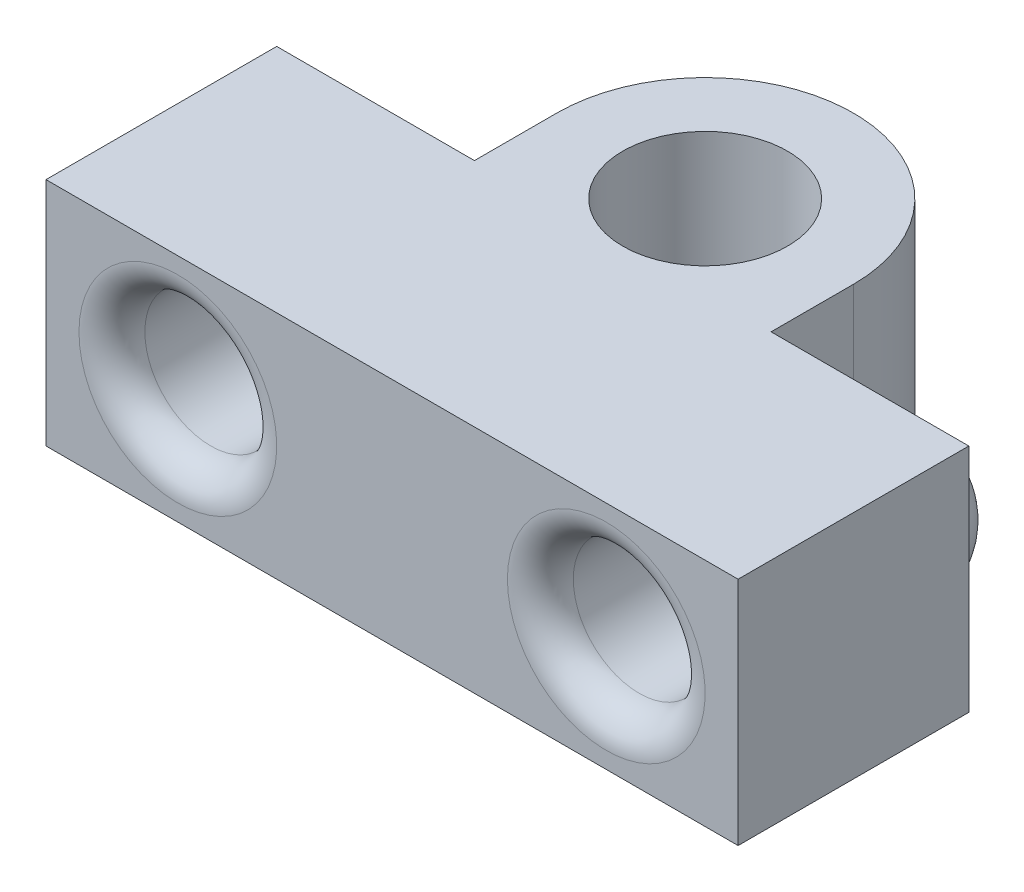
ISO-10303-21;
HEADER;
FILE_DESCRIPTION(('STEP AP214'),'2;1');
FILE_NAME('part.step','',(''),(''),'','','');
FILE_SCHEMA(('AUTOMOTIVE_DESIGN { 1 0 10303 214 1 1 1 1 }'));
ENDSEC;
DATA;
#1=APPLICATION_CONTEXT('core data for automotive mechanical design processes');
#2=APPLICATION_PROTOCOL_DEFINITION('international standard','automotive_design',2000,#1);
#3=PRODUCT_CONTEXT('',#1,'mechanical');
#4=PRODUCT('Part','Part','',(#3));
#5=PRODUCT_RELATED_PRODUCT_CATEGORY('part','',(#4));
#6=PRODUCT_DEFINITION_FORMATION('','',#4);
#7=PRODUCT_DEFINITION_CONTEXT('part definition',#1,'design');
#8=PRODUCT_DEFINITION('design','',#6,#7);
#9=PRODUCT_DEFINITION_SHAPE('','',#8);
#10=(LENGTH_UNIT() NAMED_UNIT(*) SI_UNIT(.MILLI.,.METRE.));
#11=(NAMED_UNIT(*) PLANE_ANGLE_UNIT() SI_UNIT($,.RADIAN.));
#12=(NAMED_UNIT(*) SI_UNIT($,.STERADIAN.) SOLID_ANGLE_UNIT());
#13=UNCERTAINTY_MEASURE_WITH_UNIT(LENGTH_MEASURE(1.E-05),#10,'distance_accuracy_value','');
#14=(GEOMETRIC_REPRESENTATION_CONTEXT(3) GLOBAL_UNCERTAINTY_ASSIGNED_CONTEXT((#13)) GLOBAL_UNIT_ASSIGNED_CONTEXT((#10,
#11,#12)) REPRESENTATION_CONTEXT('',''));
#15=CARTESIAN_POINT('',(0.,0.,0.));
#16=DIRECTION('',(0.,0.,1.));
#17=DIRECTION('',(1.,0.,0.));
#18=AXIS2_PLACEMENT_3D('',#15,#16,#17);
#19=CARTESIAN_POINT('',(0.,7.,0.));
#20=DIRECTION('',(0.,0.,-1.));
#21=DIRECTION('',(-1.,0.,0.));
#22=AXIS2_PLACEMENT_3D('',#19,#20,#21);
#23=PLANE('',#22);
#24=CARTESIAN_POINT('',(7.5,3.5,0.));
#25=DIRECTION('',(0.,0.,-1.));
#26=DIRECTION('',(-1.,0.,0.));
#27=AXIS2_PLACEMENT_3D('',#24,#25,#26);
#28=CIRCLE('',#27,2.25);
#29=CARTESIAN_POINT('',(5.25,3.5,0.));
#30=VERTEX_POINT('',#29);
#31=EDGE_CURVE('E184',#30,#30,#28,.T.);
#32=ORIENTED_EDGE('',*,*,#31,.F.);
#33=EDGE_LOOP('',(#32));
#34=FACE_BOUND('',#33,.T.);
#35=DIRECTION('',(1.,0.,0.));
#36=VECTOR('',#35,1.);
#37=CARTESIAN_POINT('',(0.,0.,0.));
#38=LINE('',#37,#36);
#39=CARTESIAN_POINT('',(4.50000000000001,0.,0.));
#40=VERTEX_POINT('',#39);
#41=CARTESIAN_POINT('',(10.5,0.,0.));
#42=VERTEX_POINT('',#41);
#43=EDGE_CURVE('E140',#40,#42,#38,.T.);
#44=ORIENTED_EDGE('',*,*,#43,.F.);
#45=DIRECTION('',(0.,-1.,0.));
#46=VECTOR('',#45,1.);
#47=CARTESIAN_POINT('',(4.50000000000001,7.,0.));
#48=LINE('',#47,#46);
#49=CARTESIAN_POINT('',(4.50000000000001,7.,0.));
#50=VERTEX_POINT('',#49);
#51=EDGE_CURVE('E94',#50,#40,#48,.T.);
#52=ORIENTED_EDGE('',*,*,#51,.F.);
#53=DIRECTION('',(1.,0.,0.));
#54=VECTOR('',#53,1.);
#55=CARTESIAN_POINT('',(0.,7.,0.));
#56=LINE('',#55,#54);
#57=CARTESIAN_POINT('',(10.5,7.,0.));
#58=VERTEX_POINT('',#57);
#59=EDGE_CURVE('E163',#50,#58,#56,.T.);
#60=ORIENTED_EDGE('',*,*,#59,.T.);
#61=DIRECTION('',(0.,-1.,0.));
#62=VECTOR('',#61,1.);
#63=CARTESIAN_POINT('',(10.5,7.,0.));
#64=LINE('',#63,#62);
#65=EDGE_CURVE('E58',#58,#42,#64,.T.);
#66=ORIENTED_EDGE('',*,*,#65,.T.);
#67=EDGE_LOOP('',(#44,#52,#60,#66));
#68=FACE_BOUND('',#67,.T.);
#69=ADVANCED_FACE('F39',(#34,#68),#23,.T.);
#70=CARTESIAN_POINT('',(4.50000000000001,7.,0.));
#71=DIRECTION('',(1.,0.,0.));
#72=DIRECTION('',(0.,0.,-1.));
#73=AXIS2_PLACEMENT_3D('',#70,#71,#72);
#74=PLANE('',#73);
#75=DIRECTION('',(0.,0.,1.));
#76=VECTOR('',#75,1.);
#77=CARTESIAN_POINT('',(4.50000000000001,0.,0.));
#78=LINE('',#77,#76);
#79=CARTESIAN_POINT('',(4.50000000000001,0.,-2.5));
#80=VERTEX_POINT('',#79);
#81=EDGE_CURVE('E142',#80,#40,#78,.T.);
#82=ORIENTED_EDGE('',*,*,#81,.F.);
#83=DIRECTION('',(0.,-1.,0.));
#84=VECTOR('',#83,1.);
#85=CARTESIAN_POINT('',(4.50000000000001,7.,-2.5));
#86=LINE('',#85,#84);
#87=CARTESIAN_POINT('',(4.50000000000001,7.,-2.5));
#88=VERTEX_POINT('',#87);
#89=EDGE_CURVE('E172',#88,#80,#86,.T.);
#90=ORIENTED_EDGE('',*,*,#89,.F.);
#91=DIRECTION('',(0.,0.,1.));
#92=VECTOR('',#91,1.);
#93=CARTESIAN_POINT('',(4.50000000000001,7.,0.));
#94=LINE('',#93,#92);
#95=EDGE_CURVE('E201',#88,#50,#94,.T.);
#96=ORIENTED_EDGE('',*,*,#95,.T.);
#97=ORIENTED_EDGE('',*,*,#51,.T.);
#98=EDGE_LOOP('',(#82,#90,#96,#97));
#99=FACE_BOUND('',#98,.T.);
#100=ADVANCED_FACE('F229',(#99),#74,.T.);
#101=CARTESIAN_POINT('',(0.,7.,-2.5));
#102=DIRECTION('',(0.,-1.,0.));
#103=DIRECTION('',(0.,0.,-1.));
#104=AXIS2_PLACEMENT_3D('',#101,#102,#103);
#105=CYLINDRICAL_SURFACE('',#104,4.5);
#106=CARTESIAN_POINT('',(0.,0.,-2.5));
#107=DIRECTION('',(0.,1.,0.));
#108=DIRECTION('',(0.,0.,1.));
#109=AXIS2_PLACEMENT_3D('',#106,#107,#108);
#110=CIRCLE('',#109,4.5);
#111=CARTESIAN_POINT('',(-4.49999999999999,0.,-2.5));
#112=VERTEX_POINT('',#111);
#113=EDGE_CURVE('E146',#80,#112,#110,.T.);
#114=ORIENTED_EDGE('',*,*,#113,.T.);
#115=DIRECTION('',(0.,-1.,0.));
#116=VECTOR('',#115,1.);
#117=CARTESIAN_POINT('',(-4.49999999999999,7.,-2.5));
#118=LINE('',#117,#116);
#119=CARTESIAN_POINT('',(-4.49999999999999,7.,-2.5));
#120=VERTEX_POINT('',#119);
#121=EDGE_CURVE('E169',#120,#112,#118,.T.);
#122=ORIENTED_EDGE('',*,*,#121,.F.);
#123=CARTESIAN_POINT('',(0.,7.,-2.5));
#124=DIRECTION('',(0.,1.,0.));
#125=DIRECTION('',(0.,0.,1.));
#126=AXIS2_PLACEMENT_3D('',#123,#124,#125);
#127=CIRCLE('',#126,4.5);
#128=EDGE_CURVE('E204',#88,#120,#127,.T.);
#129=ORIENTED_EDGE('',*,*,#128,.F.);
#130=ORIENTED_EDGE('',*,*,#89,.T.);
#131=EDGE_LOOP('',(#114,#122,#129,#130));
#132=FACE_BOUND('',#131,.T.);
#133=ADVANCED_FACE('F237',(#132),#105,.T.);
#134=CARTESIAN_POINT('',(-4.49999999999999,7.,0.));
#135=DIRECTION('',(1.,0.,0.));
#136=DIRECTION('',(0.,0.,-1.));
#137=AXIS2_PLACEMENT_3D('',#134,#135,#136);
#138=PLANE('',#137);
#139=DIRECTION('',(0.,0.,1.));
#140=VECTOR('',#139,1.);
#141=CARTESIAN_POINT('',(-4.49999999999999,0.,0.));
#142=LINE('',#141,#140);
#143=CARTESIAN_POINT('',(-4.49999999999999,0.,0.));
#144=VERTEX_POINT('',#143);
#145=EDGE_CURVE('E148',#112,#144,#142,.T.);
#146=ORIENTED_EDGE('',*,*,#145,.T.);
#147=DIRECTION('',(0.,-1.,0.));
#148=VECTOR('',#147,1.);
#149=CARTESIAN_POINT('',(-4.49999999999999,7.,0.));
#150=LINE('',#149,#148);
#151=CARTESIAN_POINT('',(-4.49999999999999,7.,0.));
#152=VERTEX_POINT('',#151);
#153=EDGE_CURVE('E167',#152,#144,#150,.T.);
#154=ORIENTED_EDGE('',*,*,#153,.F.);
#155=DIRECTION('',(0.,0.,1.));
#156=VECTOR('',#155,1.);
#157=CARTESIAN_POINT('',(-4.49999999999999,7.,0.));
#158=LINE('',#157,#156);
#159=EDGE_CURVE('E206',#120,#152,#158,.T.);
#160=ORIENTED_EDGE('',*,*,#159,.F.);
#161=ORIENTED_EDGE('',*,*,#121,.T.);
#162=EDGE_LOOP('',(#146,#154,#160,#161));
#163=FACE_BOUND('',#162,.T.);
#164=ADVANCED_FACE('F384',(#163),#138,.F.);
#165=CARTESIAN_POINT('',(0.,7.,0.));
#166=DIRECTION('',(0.,0.,-1.));
#167=DIRECTION('',(-1.,0.,0.));
#168=AXIS2_PLACEMENT_3D('',#165,#166,#167);
#169=PLANE('',#168);
#170=CARTESIAN_POINT('',(-7.5,3.5,0.));
#171=DIRECTION('',(0.,0.,-1.));
#172=DIRECTION('',(-1.,0.,0.));
#173=AXIS2_PLACEMENT_3D('',#170,#171,#172);
#174=CIRCLE('',#173,2.25);
#175=CARTESIAN_POINT('',(-9.75000000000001,3.5,0.));
#176=VERTEX_POINT('',#175);
#177=EDGE_CURVE('E188',#176,#176,#174,.T.);
#178=ORIENTED_EDGE('',*,*,#177,.F.);
#179=EDGE_LOOP('',(#178));
#180=FACE_BOUND('',#179,.T.);
#181=DIRECTION('',(1.,0.,0.));
#182=VECTOR('',#181,1.);
#183=CARTESIAN_POINT('',(0.,0.,0.));
#184=LINE('',#183,#182);
#185=CARTESIAN_POINT('',(-10.5,0.,0.));
#186=VERTEX_POINT('',#185);
#187=EDGE_CURVE('E151',#186,#144,#184,.T.);
#188=ORIENTED_EDGE('',*,*,#187,.F.);
#189=DIRECTION('',(0.,-1.,0.));
#190=VECTOR('',#189,1.);
#191=CARTESIAN_POINT('',(-10.5,7.,0.));
#192=LINE('',#191,#190);
#193=CARTESIAN_POINT('',(-10.5,7.,0.));
#194=VERTEX_POINT('',#193);
#195=EDGE_CURVE('E129',#194,#186,#192,.T.);
#196=ORIENTED_EDGE('',*,*,#195,.F.);
#197=DIRECTION('',(1.,0.,0.));
#198=VECTOR('',#197,1.);
#199=CARTESIAN_POINT('',(0.,7.,0.));
#200=LINE('',#199,#198);
#201=EDGE_CURVE('E119',#194,#152,#200,.T.);
#202=ORIENTED_EDGE('',*,*,#201,.T.);
#203=ORIENTED_EDGE('',*,*,#153,.T.);
#204=EDGE_LOOP('',(#188,#196,#202,#203));
#205=FACE_BOUND('',#204,.T.);
#206=ADVANCED_FACE('F209',(#180,#205),#169,.T.);
#207=CARTESIAN_POINT('',(-10.5,7.,0.));
#208=DIRECTION('',(1.,0.,0.));
#209=DIRECTION('',(0.,0.,-1.));
#210=AXIS2_PLACEMENT_3D('',#207,#208,#209);
#211=PLANE('',#210);
#212=DIRECTION('',(0.,0.,1.));
#213=VECTOR('',#212,1.);
#214=CARTESIAN_POINT('',(-10.5,0.,0.));
#215=LINE('',#214,#213);
#216=CARTESIAN_POINT('',(-10.5,0.,7.));
#217=VERTEX_POINT('',#216);
#218=EDGE_CURVE('E126',#186,#217,#215,.T.);
#219=ORIENTED_EDGE('',*,*,#218,.T.);
#220=DIRECTION('',(0.,-1.,0.));
#221=VECTOR('',#220,1.);
#222=CARTESIAN_POINT('',(-10.5,7.,7.));
#223=LINE('',#222,#221);
#224=CARTESIAN_POINT('',(-10.5,7.,7.));
#225=VERTEX_POINT('',#224);
#226=EDGE_CURVE('E123',#225,#217,#223,.T.);
#227=ORIENTED_EDGE('',*,*,#226,.F.);
#228=DIRECTION('',(0.,0.,1.));
#229=VECTOR('',#228,1.);
#230=CARTESIAN_POINT('',(-10.5,7.,0.));
#231=LINE('',#230,#229);
#232=EDGE_CURVE('E111',#194,#225,#231,.T.);
#233=ORIENTED_EDGE('',*,*,#232,.F.);
#234=ORIENTED_EDGE('',*,*,#195,.T.);
#235=EDGE_LOOP('',(#219,#227,#233,#234));
#236=FACE_BOUND('',#235,.T.);
#237=ADVANCED_FACE('F124',(#236),#211,.F.);
#238=CARTESIAN_POINT('',(0.,7.,7.));
#239=DIRECTION('',(0.,0.,-1.));
#240=DIRECTION('',(-1.,0.,0.));
#241=AXIS2_PLACEMENT_3D('',#238,#239,#240);
#242=PLANE('',#241);
#243=CARTESIAN_POINT('',(6.5,3.5,7.));
#244=DIRECTION('',(0.,0.,-1.));
#245=DIRECTION('',(-1.,0.,0.));
#246=AXIS2_PLACEMENT_3D('',#243,#244,#245);
#247=CIRCLE('',#246,3.);
#248=CARTESIAN_POINT('',(3.5,3.5,7.));
#249=VERTEX_POINT('',#248);
#250=EDGE_CURVE('E49',#249,#249,#247,.T.);
#251=ORIENTED_EDGE('',*,*,#250,.T.);
#252=EDGE_LOOP('',(#251));
#253=FACE_BOUND('',#252,.T.);
#254=CARTESIAN_POINT('',(-6.5,3.5,7.));
#255=DIRECTION('',(0.,0.,-1.));
#256=DIRECTION('',(-1.,0.,0.));
#257=AXIS2_PLACEMENT_3D('',#254,#255,#256);
#258=CIRCLE('',#257,3.);
#259=CARTESIAN_POINT('',(-9.5,3.5,7.));
#260=VERTEX_POINT('',#259);
#261=EDGE_CURVE('E178',#260,#260,#258,.T.);
#262=ORIENTED_EDGE('',*,*,#261,.T.);
#263=EDGE_LOOP('',(#262));
#264=FACE_BOUND('',#263,.T.);
#265=DIRECTION('',(1.,0.,0.));
#266=VECTOR('',#265,1.);
#267=CARTESIAN_POINT('',(0.,0.,7.));
#268=LINE('',#267,#266);
#269=CARTESIAN_POINT('',(10.5,0.,7.));
#270=VERTEX_POINT('',#269);
#271=EDGE_CURVE('E155',#217,#270,#268,.T.);
#272=ORIENTED_EDGE('',*,*,#271,.T.);
#273=DIRECTION('',(0.,-1.,0.));
#274=VECTOR('',#273,1.);
#275=CARTESIAN_POINT('',(10.5,7.,7.));
#276=LINE('',#275,#274);
#277=CARTESIAN_POINT('',(10.5,7.,7.));
#278=VERTEX_POINT('',#277);
#279=EDGE_CURVE('E85',#278,#270,#276,.T.);
#280=ORIENTED_EDGE('',*,*,#279,.F.);
#281=DIRECTION('',(1.,0.,0.));
#282=VECTOR('',#281,1.);
#283=CARTESIAN_POINT('',(0.,7.,7.));
#284=LINE('',#283,#282);
#285=EDGE_CURVE('E117',#225,#278,#284,.T.);
#286=ORIENTED_EDGE('',*,*,#285,.F.);
#287=ORIENTED_EDGE('',*,*,#226,.T.);
#288=EDGE_LOOP('',(#272,#280,#286,#287));
#289=FACE_BOUND('',#288,.T.);
#290=ADVANCED_FACE('F131',(#253,#264,#289),#242,.F.);
#291=CARTESIAN_POINT('',(10.5,7.,0.));
#292=DIRECTION('',(1.,0.,0.));
#293=DIRECTION('',(0.,0.,-1.));
#294=AXIS2_PLACEMENT_3D('',#291,#292,#293);
#295=PLANE('',#294);
#296=DIRECTION('',(0.,0.,1.));
#297=VECTOR('',#296,1.);
#298=CARTESIAN_POINT('',(10.5,0.,0.));
#299=LINE('',#298,#297);
#300=EDGE_CURVE('E157',#42,#270,#299,.T.);
#301=ORIENTED_EDGE('',*,*,#300,.F.);
#302=ORIENTED_EDGE('',*,*,#65,.F.);
#303=DIRECTION('',(0.,0.,1.));
#304=VECTOR('',#303,1.);
#305=CARTESIAN_POINT('',(10.5,7.,0.));
#306=LINE('',#305,#304);
#307=EDGE_CURVE('E132',#58,#278,#306,.T.);
#308=ORIENTED_EDGE('',*,*,#307,.T.);
#309=ORIENTED_EDGE('',*,*,#279,.T.);
#310=EDGE_LOOP('',(#301,#302,#308,#309));
#311=FACE_BOUND('',#310,.T.);
#312=ADVANCED_FACE('F215',(#311),#295,.T.);
#313=CARTESIAN_POINT('',(0.,7.,-2.5));
#314=DIRECTION('',(0.,-1.,0.));
#315=DIRECTION('',(0.,0.,-1.));
#316=AXIS2_PLACEMENT_3D('',#313,#314,#315);
#317=CYLINDRICAL_SURFACE('',#316,2.5);
#318=CARTESIAN_POINT('',(0.,7.,-2.5));
#319=DIRECTION('',(0.,1.,0.));
#320=DIRECTION('',(0.,0.,1.));
#321=AXIS2_PLACEMENT_3D('',#318,#319,#320);
#322=CIRCLE('',#321,2.5);
#323=CARTESIAN_POINT('',(0.,7.,0.));
#324=VERTEX_POINT('',#323);
#325=EDGE_CURVE('E134',#324,#324,#322,.T.);
#326=ORIENTED_EDGE('',*,*,#325,.T.);
#327=EDGE_LOOP('',(#326));
#328=FACE_BOUND('',#327,.T.);
#329=CARTESIAN_POINT('',(0.,0.,-2.5));
#330=DIRECTION('',(0.,1.,0.));
#331=DIRECTION('',(0.,0.,1.));
#332=AXIS2_PLACEMENT_3D('',#329,#330,#331);
#333=CIRCLE('',#332,2.5);
#334=CARTESIAN_POINT('',(0.,0.,0.));
#335=VERTEX_POINT('',#334);
#336=EDGE_CURVE('E160',#335,#335,#333,.T.);
#337=ORIENTED_EDGE('',*,*,#336,.F.);
#338=EDGE_LOOP('',(#337));
#339=FACE_BOUND('',#338,.T.);
#340=ADVANCED_FACE('F217',(#328,#339),#317,.F.);
#341=CARTESIAN_POINT('',(0.,7.,0.));
#342=DIRECTION('',(0.,1.,0.));
#343=DIRECTION('',(0.,0.,1.));
#344=AXIS2_PLACEMENT_3D('',#341,#342,#343);
#345=PLANE('',#344);
#346=ORIENTED_EDGE('',*,*,#59,.F.);
#347=ORIENTED_EDGE('',*,*,#95,.F.);
#348=ORIENTED_EDGE('',*,*,#128,.T.);
#349=ORIENTED_EDGE('',*,*,#159,.T.);
#350=ORIENTED_EDGE('',*,*,#201,.F.);
#351=ORIENTED_EDGE('',*,*,#232,.T.);
#352=ORIENTED_EDGE('',*,*,#285,.T.);
#353=ORIENTED_EDGE('',*,*,#307,.F.);
#354=EDGE_LOOP('',(#346,#347,#348,#349,#350,#351,#352,#353));
#355=FACE_BOUND('',#354,.T.);
#356=ORIENTED_EDGE('',*,*,#325,.F.);
#357=EDGE_LOOP('',(#356));
#358=FACE_BOUND('',#357,.T.);
#359=ADVANCED_FACE('F113',(#355,#358),#345,.T.);
#360=CARTESIAN_POINT('',(0.,0.,0.));
#361=DIRECTION('',(0.,1.,0.));
#362=DIRECTION('',(0.,0.,1.));
#363=AXIS2_PLACEMENT_3D('',#360,#361,#362);
#364=PLANE('',#363);
#365=ORIENTED_EDGE('',*,*,#43,.T.);
#366=ORIENTED_EDGE('',*,*,#300,.T.);
#367=ORIENTED_EDGE('',*,*,#271,.F.);
#368=ORIENTED_EDGE('',*,*,#218,.F.);
#369=ORIENTED_EDGE('',*,*,#187,.T.);
#370=ORIENTED_EDGE('',*,*,#145,.F.);
#371=ORIENTED_EDGE('',*,*,#113,.F.);
#372=ORIENTED_EDGE('',*,*,#81,.T.);
#373=EDGE_LOOP('',(#365,#366,#367,#368,#369,#370,#371,#372));
#374=FACE_BOUND('',#373,.T.);
#375=ORIENTED_EDGE('',*,*,#336,.T.);
#376=EDGE_LOOP('',(#375));
#377=FACE_BOUND('',#376,.T.);
#378=ADVANCED_FACE('F212',(#374,#377),#364,.F.);
#379=CARTESIAN_POINT('',(6.5,3.5,0.299999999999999));
#380=DIRECTION('',(0.,0.,1.));
#381=DIRECTION('',(1.,0.,0.));
#382=AXIS2_PLACEMENT_3D('',#379,#380,#381);
#383=CYLINDRICAL_SURFACE('',#382,2.);
#384=CARTESIAN_POINT('',(6.5,3.5,6.));
#385=DIRECTION('',(0.,0.,-1.));
#386=DIRECTION('',(-1.,0.,0.));
#387=AXIS2_PLACEMENT_3D('',#384,#385,#386);
#388=CIRCLE('',#387,2.);
#389=CARTESIAN_POINT('',(4.5,3.5,6.));
#390=VERTEX_POINT('',#389);
#391=EDGE_CURVE('E175',#390,#390,#388,.F.);
#392=ORIENTED_EDGE('',*,*,#391,.T.);
#393=EDGE_LOOP('',(#392));
#394=FACE_BOUND('',#393,.T.);
#395=CARTESIAN_POINT('',(6.5,3.5,0.299999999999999));
#396=DIRECTION('',(0.,0.,1.));
#397=DIRECTION('',(1.,0.,0.));
#398=AXIS2_PLACEMENT_3D('',#395,#396,#397);
#399=CIRCLE('',#398,2.);
#400=CARTESIAN_POINT('',(8.5,3.5,0.299999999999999));
#401=VERTEX_POINT('',#400);
#402=EDGE_CURVE('E197',#401,#401,#399,.T.);
#403=ORIENTED_EDGE('',*,*,#402,.F.);
#404=EDGE_LOOP('',(#403));
#405=FACE_BOUND('',#404,.T.);
#406=ADVANCED_FACE('F274',(#394,#405),#383,.F.);
#407=CARTESIAN_POINT('',(6.5,3.5,0.299999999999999));
#408=DIRECTION('',(0.,0.,1.));
#409=DIRECTION('',(1.,0.,0.));
#410=AXIS2_PLACEMENT_3D('',#407,#408,#409);
#411=PLANE('',#410);
#412=ORIENTED_EDGE('',*,*,#402,.T.);
#413=EDGE_LOOP('',(#412));
#414=FACE_BOUND('',#413,.T.);
#415=ADVANCED_FACE('F272',(#414),#411,.T.);
#416=CARTESIAN_POINT('',(-6.5,3.5,0.299999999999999));
#417=DIRECTION('',(0.,0.,1.));
#418=DIRECTION('',(1.,0.,0.));
#419=AXIS2_PLACEMENT_3D('',#416,#417,#418);
#420=CYLINDRICAL_SURFACE('',#419,2.);
#421=CARTESIAN_POINT('',(-6.5,3.5,6.));
#422=DIRECTION('',(0.,0.,-1.));
#423=DIRECTION('',(-1.,0.,0.));
#424=AXIS2_PLACEMENT_3D('',#421,#422,#423);
#425=CIRCLE('',#424,2.);
#426=CARTESIAN_POINT('',(-8.5,3.5,6.));
#427=VERTEX_POINT('',#426);
#428=EDGE_CURVE('E11',#427,#427,#425,.F.);
#429=ORIENTED_EDGE('',*,*,#428,.T.);
#430=EDGE_LOOP('',(#429));
#431=FACE_BOUND('',#430,.T.);
#432=CARTESIAN_POINT('',(-6.5,3.5,0.299999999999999));
#433=DIRECTION('',(0.,0.,1.));
#434=DIRECTION('',(1.,0.,0.));
#435=AXIS2_PLACEMENT_3D('',#432,#433,#434);
#436=CIRCLE('',#435,2.);
#437=CARTESIAN_POINT('',(-4.5,3.5,0.299999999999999));
#438=VERTEX_POINT('',#437);
#439=EDGE_CURVE('E143',#438,#438,#436,.T.);
#440=ORIENTED_EDGE('',*,*,#439,.F.);
#441=EDGE_LOOP('',(#440));
#442=FACE_BOUND('',#441,.T.);
#443=ADVANCED_FACE('F268',(#431,#442),#420,.F.);
#444=CARTESIAN_POINT('',(-6.5,3.5,0.299999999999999));
#445=DIRECTION('',(0.,0.,1.));
#446=DIRECTION('',(1.,0.,0.));
#447=AXIS2_PLACEMENT_3D('',#444,#445,#446);
#448=PLANE('',#447);
#449=ORIENTED_EDGE('',*,*,#439,.T.);
#450=EDGE_LOOP('',(#449));
#451=FACE_BOUND('',#450,.T.);
#452=ADVANCED_FACE('F246',(#451),#448,.T.);
#453=CARTESIAN_POINT('',(6.5,3.5,6.));
#454=DIRECTION('',(0.,0.,-1.));
#455=DIRECTION('',(-1.,0.,0.));
#456=AXIS2_PLACEMENT_3D('',#453,#454,#455);
#457=TOROIDAL_SURFACE('',#456,3.,1.);
#458=ORIENTED_EDGE('',*,*,#250,.F.);
#459=EDGE_LOOP('',(#458));
#460=FACE_BOUND('',#459,.T.);
#461=ORIENTED_EDGE('',*,*,#391,.F.);
#462=EDGE_LOOP('',(#461));
#463=FACE_BOUND('',#462,.T.);
#464=ADVANCED_FACE('F242',(#460,#463),#457,.T.);
#465=CARTESIAN_POINT('',(-6.5,3.5,6.));
#466=DIRECTION('',(0.,0.,-1.));
#467=DIRECTION('',(-1.,0.,0.));
#468=AXIS2_PLACEMENT_3D('',#465,#466,#467);
#469=TOROIDAL_SURFACE('',#468,3.,1.);
#470=ORIENTED_EDGE('',*,*,#261,.F.);
#471=EDGE_LOOP('',(#470));
#472=FACE_BOUND('',#471,.T.);
#473=ORIENTED_EDGE('',*,*,#428,.F.);
#474=EDGE_LOOP('',(#473));
#475=FACE_BOUND('',#474,.T.);
#476=ADVANCED_FACE('F245',(#472,#475),#469,.T.);
#477=CARTESIAN_POINT('',(-7.5,3.5,-0.0999999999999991));
#478=DIRECTION('',(0.,0.,1.));
#479=DIRECTION('',(1.,0.,0.));
#480=AXIS2_PLACEMENT_3D('',#477,#478,#479);
#481=CYLINDRICAL_SURFACE('',#480,2.25);
#482=CARTESIAN_POINT('',(-7.5,3.5,-0.0999999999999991));
#483=DIRECTION('',(0.,0.,-1.));
#484=DIRECTION('',(-1.,0.,0.));
#485=AXIS2_PLACEMENT_3D('',#482,#483,#484);
#486=CIRCLE('',#485,2.25);
#487=CARTESIAN_POINT('',(-9.75000000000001,3.5,-0.0999999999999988));
#488=VERTEX_POINT('',#487);
#489=EDGE_CURVE('E43',#488,#488,#486,.T.);
#490=ORIENTED_EDGE('',*,*,#489,.F.);
#491=EDGE_LOOP('',(#490));
#492=FACE_BOUND('',#491,.T.);
#493=ORIENTED_EDGE('',*,*,#177,.T.);
#494=EDGE_LOOP('',(#493));
#495=FACE_BOUND('',#494,.T.);
#496=ADVANCED_FACE('F248',(#492,#495),#481,.T.);
#497=CARTESIAN_POINT('',(-7.5,3.5,-0.0999999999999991));
#498=DIRECTION('',(0.,0.,1.));
#499=DIRECTION('',(1.,0.,0.));
#500=AXIS2_PLACEMENT_3D('',#497,#498,#499);
#501=SPHERICAL_SURFACE('',#500,2.25);
#502=ORIENTED_EDGE('',*,*,#489,.T.);
#503=EDGE_LOOP('',(#502));
#504=FACE_BOUND('',#503,.T.);
#505=ADVANCED_FACE('F41',(#504),#501,.T.);
#506=CARTESIAN_POINT('',(7.5,3.5,-0.100000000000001));
#507=DIRECTION('',(0.,0.,1.));
#508=DIRECTION('',(1.,0.,0.));
#509=AXIS2_PLACEMENT_3D('',#506,#507,#508);
#510=CYLINDRICAL_SURFACE('',#509,2.25);
#511=CARTESIAN_POINT('',(7.5,3.5,-0.100000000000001));
#512=DIRECTION('',(0.,0.,-1.));
#513=DIRECTION('',(-1.,0.,0.));
#514=AXIS2_PLACEMENT_3D('',#511,#512,#513);
#515=CIRCLE('',#514,2.25);
#516=CARTESIAN_POINT('',(5.25,3.5,-0.100000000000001));
#517=VERTEX_POINT('',#516);
#518=EDGE_CURVE('E182',#517,#517,#515,.T.);
#519=ORIENTED_EDGE('',*,*,#518,.F.);
#520=EDGE_LOOP('',(#519));
#521=FACE_BOUND('',#520,.T.);
#522=ORIENTED_EDGE('',*,*,#31,.T.);
#523=EDGE_LOOP('',(#522));
#524=FACE_BOUND('',#523,.T.);
#525=ADVANCED_FACE('F252',(#521,#524),#510,.T.);
#526=CARTESIAN_POINT('',(7.5,3.5,-0.100000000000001));
#527=DIRECTION('',(0.,0.,1.));
#528=DIRECTION('',(1.,0.,0.));
#529=AXIS2_PLACEMENT_3D('',#526,#527,#528);
#530=SPHERICAL_SURFACE('',#529,2.25);
#531=ORIENTED_EDGE('',*,*,#518,.T.);
#532=EDGE_LOOP('',(#531));
#533=FACE_BOUND('',#532,.T.);
#534=ADVANCED_FACE('F250',(#533),#530,.T.);
#535=CLOSED_SHELL('',(#69,#100,#133,#164,#206,#237,#290,#312,#340,#359,#378,#406,#415,#443,#452,
#464,#476,#496,#505,#525,#534));
#536=MANIFOLD_SOLID_BREP('B2',#535);
#537=ADVANCED_BREP_SHAPE_REPRESENTATION('',(#18,#536),#14);
#538=SHAPE_DEFINITION_REPRESENTATION(#9,#537);
ENDSEC;
END-ISO-10303-21;
